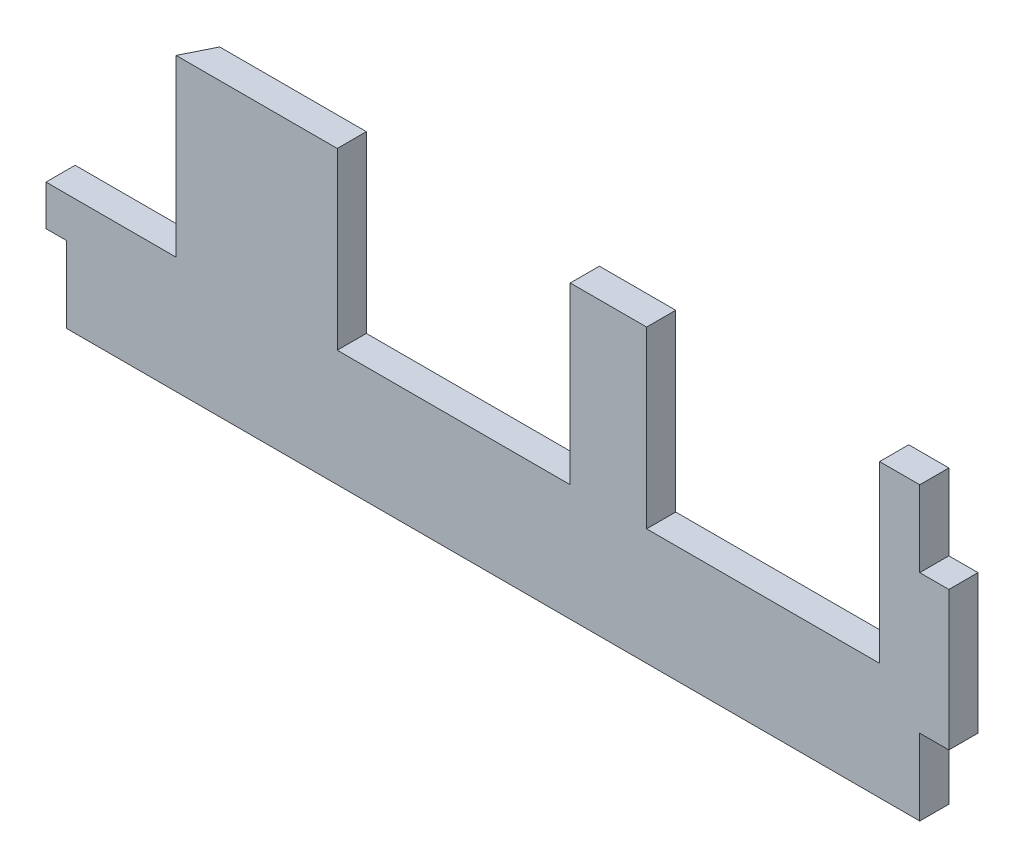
from build123d import *

# Parameters (mm, degrees)
EXTRUDE1_DEPTH     = 12.7
SKETCH2_W          = 101.6
SKETCH2_H          = 12.7
CUT_EXTRUDE1_DEPTH = 76.2


with BuildPart() as part:
    # Sketch1 → Extrude1 (new body)
    with BuildSketch(Plane.XY):
        Polygon((-28.754754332, 131.379168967), (-28.754754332, 98.188624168), (-400.774498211, 98.188624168), (-400.774498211, 131.379168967), (-409.754754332, 131.379168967), (-409.754754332, 225.188624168), (-28.754754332, 225.188624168), (-28.754754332, 191.998079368), (-16.054754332, 191.998079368), (-16.054754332, 131.379168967), align=None)
    extrude(amount=-EXTRUDE1_DEPTH)

    # Sketch2 → Cut-Extrude1 (cut)
    with BuildSketch(Plane(origin=(0, 225.188624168, 0), x_dir=(1, 0, 0), z_dir=(0, 1, 0))):
        with Locations((-231.954754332, 6.35)):
            Rectangle(SKETCH2_W, SKETCH2_H)
        Polygon((-409.754754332, 12.7), (-409.754754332, 0), (-353.025346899, 0), (-346.712732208, 12.7), align=None)
        with Locations((-97.063985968, 6.35)):
            Rectangle(SKETCH2_W, SKETCH2_H)
    extrude(amount=-CUT_EXTRUDE1_DEPTH, mode=Mode.SUBTRACT)


solid = part.part
